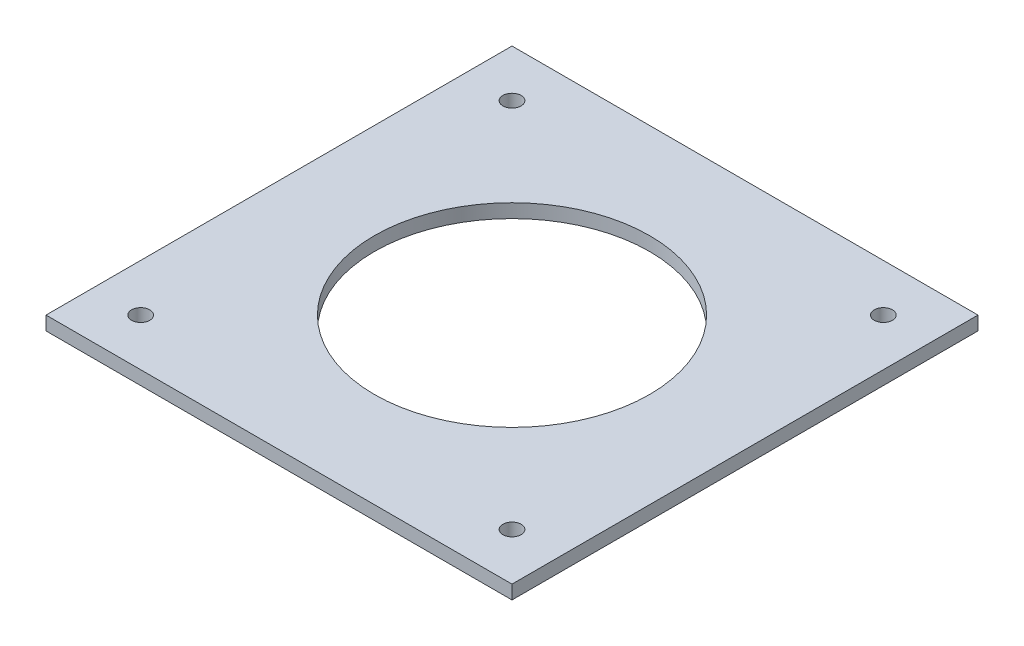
ISO-10303-21;
HEADER;
FILE_DESCRIPTION(('STEP AP214'),'2;1');
FILE_NAME('part.step','',(''),(''),'','','');
FILE_SCHEMA(('AUTOMOTIVE_DESIGN { 1 0 10303 214 1 1 1 1 }'));
ENDSEC;
DATA;
#1=APPLICATION_CONTEXT('core data for automotive mechanical design processes');
#2=APPLICATION_PROTOCOL_DEFINITION('international standard','automotive_design',2000,#1);
#3=PRODUCT_CONTEXT('',#1,'mechanical');
#4=PRODUCT('Part','Part','',(#3));
#5=PRODUCT_RELATED_PRODUCT_CATEGORY('part','',(#4));
#6=PRODUCT_DEFINITION_FORMATION('','',#4);
#7=PRODUCT_DEFINITION_CONTEXT('part definition',#1,'design');
#8=PRODUCT_DEFINITION('design','',#6,#7);
#9=PRODUCT_DEFINITION_SHAPE('','',#8);
#10=(LENGTH_UNIT() NAMED_UNIT(*) SI_UNIT(.MILLI.,.METRE.));
#11=(NAMED_UNIT(*) PLANE_ANGLE_UNIT() SI_UNIT($,.RADIAN.));
#12=(NAMED_UNIT(*) SI_UNIT($,.STERADIAN.) SOLID_ANGLE_UNIT());
#13=UNCERTAINTY_MEASURE_WITH_UNIT(LENGTH_MEASURE(1.E-05),#10,'distance_accuracy_value','');
#14=(GEOMETRIC_REPRESENTATION_CONTEXT(3) GLOBAL_UNCERTAINTY_ASSIGNED_CONTEXT((#13)) GLOBAL_UNIT_ASSIGNED_CONTEXT((#10,
#11,#12)) REPRESENTATION_CONTEXT('',''));
#15=CARTESIAN_POINT('',(0.,0.,0.));
#16=DIRECTION('',(0.,0.,1.));
#17=DIRECTION('',(1.,0.,0.));
#18=AXIS2_PLACEMENT_3D('',#15,#16,#17);
#19=CARTESIAN_POINT('',(0.,3.,0.));
#20=DIRECTION('',(0.,1.,0.));
#21=DIRECTION('',(0.,0.,1.));
#22=AXIS2_PLACEMENT_3D('',#19,#20,#21);
#23=PLANE('',#22);
#24=CARTESIAN_POINT('',(40.4799999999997,3.,40.4800000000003));
#25=DIRECTION('',(0.,1.,0.));
#26=DIRECTION('',(0.,0.,1.));
#27=AXIS2_PLACEMENT_3D('',#24,#25,#26);
#28=CIRCLE('',#27,1.98499999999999);
#29=CARTESIAN_POINT('',(40.4799999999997,3.,42.4650000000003));
#30=VERTEX_POINT('',#29);
#31=EDGE_CURVE('E156',#30,#30,#28,.T.);
#32=ORIENTED_EDGE('',*,*,#31,.F.);
#33=EDGE_LOOP('',(#32));
#34=FACE_BOUND('',#33,.T.);
#35=CARTESIAN_POINT('',(-40.48,3.,-40.48));
#36=DIRECTION('',(0.,1.,0.));
#37=DIRECTION('',(0.,0.,1.));
#38=AXIS2_PLACEMENT_3D('',#35,#36,#37);
#39=CIRCLE('',#38,1.98499999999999);
#40=CARTESIAN_POINT('',(-40.48,3.,-38.495));
#41=VERTEX_POINT('',#40);
#42=EDGE_CURVE('E140',#41,#41,#39,.T.);
#43=ORIENTED_EDGE('',*,*,#42,.F.);
#44=EDGE_LOOP('',(#43));
#45=FACE_BOUND('',#44,.T.);
#46=DIRECTION('',(0.,0.,1.));
#47=VECTOR('',#46,1.);
#48=CARTESIAN_POINT('',(-50.8,3.,-50.8));
#49=LINE('',#48,#47);
#50=CARTESIAN_POINT('',(-50.8,3.,-50.8));
#51=VERTEX_POINT('',#50);
#52=CARTESIAN_POINT('',(-50.8,3.,50.8));
#53=VERTEX_POINT('',#52);
#54=EDGE_CURVE('E98',#51,#53,#49,.T.);
#55=ORIENTED_EDGE('',*,*,#54,.T.);
#56=DIRECTION('',(1.,0.,0.));
#57=VECTOR('',#56,1.);
#58=CARTESIAN_POINT('',(-50.8,3.,50.8));
#59=LINE('',#58,#57);
#60=CARTESIAN_POINT('',(50.8,3.,50.8));
#61=VERTEX_POINT('',#60);
#62=EDGE_CURVE('E93',#53,#61,#59,.T.);
#63=ORIENTED_EDGE('',*,*,#62,.T.);
#64=DIRECTION('',(0.,0.,-1.));
#65=VECTOR('',#64,1.);
#66=CARTESIAN_POINT('',(50.8,3.,-50.8));
#67=LINE('',#66,#65);
#68=CARTESIAN_POINT('',(50.8,3.,-50.8));
#69=VERTEX_POINT('',#68);
#70=EDGE_CURVE('E96',#61,#69,#67,.T.);
#71=ORIENTED_EDGE('',*,*,#70,.T.);
#72=DIRECTION('',(-1.,0.,0.));
#73=VECTOR('',#72,1.);
#74=CARTESIAN_POINT('',(-50.8,3.,-50.8));
#75=LINE('',#74,#73);
#76=EDGE_CURVE('E63',#69,#51,#75,.T.);
#77=ORIENTED_EDGE('',*,*,#76,.T.);
#78=EDGE_LOOP('',(#55,#63,#71,#77));
#79=FACE_BOUND('',#78,.T.);
#80=CARTESIAN_POINT('',(0.,3.,0.));
#81=DIRECTION('',(0.,1.,0.));
#82=DIRECTION('',(0.,0.,1.));
#83=AXIS2_PLACEMENT_3D('',#80,#81,#82);
#84=CIRCLE('',#83,30.);
#85=CARTESIAN_POINT('',(0.,3.,30.));
#86=VERTEX_POINT('',#85);
#87=EDGE_CURVE('E118',#86,#86,#84,.T.);
#88=ORIENTED_EDGE('',*,*,#87,.F.);
#89=EDGE_LOOP('',(#88));
#90=FACE_BOUND('',#89,.T.);
#91=CARTESIAN_POINT('',(40.4800000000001,3.,-40.4799999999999));
#92=DIRECTION('',(0.,1.,0.));
#93=DIRECTION('',(0.,0.,1.));
#94=AXIS2_PLACEMENT_3D('',#91,#92,#93);
#95=CIRCLE('',#94,1.985);
#96=CARTESIAN_POINT('',(40.4800000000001,3.,-38.4949999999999));
#97=VERTEX_POINT('',#96);
#98=EDGE_CURVE('E148',#97,#97,#95,.T.);
#99=ORIENTED_EDGE('',*,*,#98,.F.);
#100=EDGE_LOOP('',(#99));
#101=FACE_BOUND('',#100,.T.);
#102=CARTESIAN_POINT('',(-40.4800000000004,3.,40.4799999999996));
#103=DIRECTION('',(0.,1.,0.));
#104=DIRECTION('',(0.,0.,1.));
#105=AXIS2_PLACEMENT_3D('',#102,#103,#104);
#106=CIRCLE('',#105,1.98499999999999);
#107=CARTESIAN_POINT('',(-40.4800000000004,3.,42.4649999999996));
#108=VERTEX_POINT('',#107);
#109=EDGE_CURVE('E164',#108,#108,#106,.T.);
#110=ORIENTED_EDGE('',*,*,#109,.F.);
#111=EDGE_LOOP('',(#110));
#112=FACE_BOUND('',#111,.T.);
#113=ADVANCED_FACE('F45',(#34,#45,#79,#90,#101,#112),#23,.T.);
#114=CARTESIAN_POINT('',(0.,0.,0.));
#115=DIRECTION('',(0.,1.,0.));
#116=DIRECTION('',(0.,0.,1.));
#117=AXIS2_PLACEMENT_3D('',#114,#115,#116);
#118=PLANE('',#117);
#119=DIRECTION('',(0.,0.,1.));
#120=VECTOR('',#119,1.);
#121=CARTESIAN_POINT('',(-50.8,0.,-50.8));
#122=LINE('',#121,#120);
#123=CARTESIAN_POINT('',(-50.8,0.,-50.8));
#124=VERTEX_POINT('',#123);
#125=CARTESIAN_POINT('',(-50.8,0.,50.8));
#126=VERTEX_POINT('',#125);
#127=EDGE_CURVE('E114',#124,#126,#122,.T.);
#128=ORIENTED_EDGE('',*,*,#127,.F.);
#129=DIRECTION('',(-1.,0.,0.));
#130=VECTOR('',#129,1.);
#131=CARTESIAN_POINT('',(-50.8,0.,-50.8));
#132=LINE('',#131,#130);
#133=CARTESIAN_POINT('',(50.8,0.,-50.8));
#134=VERTEX_POINT('',#133);
#135=EDGE_CURVE('E86',#134,#124,#132,.T.);
#136=ORIENTED_EDGE('',*,*,#135,.F.);
#137=DIRECTION('',(0.,0.,-1.));
#138=VECTOR('',#137,1.);
#139=CARTESIAN_POINT('',(50.8,0.,-50.8));
#140=LINE('',#139,#138);
#141=CARTESIAN_POINT('',(50.8,0.,50.8));
#142=VERTEX_POINT('',#141);
#143=EDGE_CURVE('E80',#142,#134,#140,.T.);
#144=ORIENTED_EDGE('',*,*,#143,.F.);
#145=DIRECTION('',(1.,0.,0.));
#146=VECTOR('',#145,1.);
#147=CARTESIAN_POINT('',(-50.8,0.,50.8));
#148=LINE('',#147,#146);
#149=EDGE_CURVE('E103',#126,#142,#148,.T.);
#150=ORIENTED_EDGE('',*,*,#149,.F.);
#151=EDGE_LOOP('',(#128,#136,#144,#150));
#152=FACE_BOUND('',#151,.T.);
#153=CARTESIAN_POINT('',(0.,0.,0.));
#154=DIRECTION('',(0.,1.,0.));
#155=DIRECTION('',(0.,0.,1.));
#156=AXIS2_PLACEMENT_3D('',#153,#154,#155);
#157=CIRCLE('',#156,30.);
#158=CARTESIAN_POINT('',(0.,0.,30.));
#159=VERTEX_POINT('',#158);
#160=EDGE_CURVE('E136',#159,#159,#157,.T.);
#161=ORIENTED_EDGE('',*,*,#160,.T.);
#162=EDGE_LOOP('',(#161));
#163=FACE_BOUND('',#162,.T.);
#164=CARTESIAN_POINT('',(-40.48,0.,-40.48));
#165=DIRECTION('',(0.,1.,0.));
#166=DIRECTION('',(0.,0.,1.));
#167=AXIS2_PLACEMENT_3D('',#164,#165,#166);
#168=CIRCLE('',#167,1.98499999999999);
#169=CARTESIAN_POINT('',(-40.48,0.,-38.495));
#170=VERTEX_POINT('',#169);
#171=EDGE_CURVE('E144',#170,#170,#168,.T.);
#172=ORIENTED_EDGE('',*,*,#171,.T.);
#173=EDGE_LOOP('',(#172));
#174=FACE_BOUND('',#173,.T.);
#175=CARTESIAN_POINT('',(40.4800000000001,0.,-40.4799999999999));
#176=DIRECTION('',(0.,1.,0.));
#177=DIRECTION('',(0.,0.,1.));
#178=AXIS2_PLACEMENT_3D('',#175,#176,#177);
#179=CIRCLE('',#178,1.985);
#180=CARTESIAN_POINT('',(40.4800000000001,0.,-38.4949999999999));
#181=VERTEX_POINT('',#180);
#182=EDGE_CURVE('E152',#181,#181,#179,.T.);
#183=ORIENTED_EDGE('',*,*,#182,.T.);
#184=EDGE_LOOP('',(#183));
#185=FACE_BOUND('',#184,.T.);
#186=CARTESIAN_POINT('',(40.4799999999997,0.,40.4800000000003));
#187=DIRECTION('',(0.,1.,0.));
#188=DIRECTION('',(0.,0.,1.));
#189=AXIS2_PLACEMENT_3D('',#186,#187,#188);
#190=CIRCLE('',#189,1.98499999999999);
#191=CARTESIAN_POINT('',(40.4799999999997,0.,42.4650000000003));
#192=VERTEX_POINT('',#191);
#193=EDGE_CURVE('E160',#192,#192,#190,.T.);
#194=ORIENTED_EDGE('',*,*,#193,.T.);
#195=EDGE_LOOP('',(#194));
#196=FACE_BOUND('',#195,.T.);
#197=CARTESIAN_POINT('',(-40.4800000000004,0.,40.4799999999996));
#198=DIRECTION('',(0.,1.,0.));
#199=DIRECTION('',(0.,0.,1.));
#200=AXIS2_PLACEMENT_3D('',#197,#198,#199);
#201=CIRCLE('',#200,1.98499999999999);
#202=CARTESIAN_POINT('',(-40.4800000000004,0.,42.4649999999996));
#203=VERTEX_POINT('',#202);
#204=EDGE_CURVE('E168',#203,#203,#201,.T.);
#205=ORIENTED_EDGE('',*,*,#204,.T.);
#206=EDGE_LOOP('',(#205));
#207=FACE_BOUND('',#206,.T.);
#208=ADVANCED_FACE('F131',(#152,#163,#174,#185,#196,#207),#118,.F.);
#209=CARTESIAN_POINT('',(-50.8,3.,-50.8));
#210=DIRECTION('',(1.,0.,0.));
#211=DIRECTION('',(0.,0.,-1.));
#212=AXIS2_PLACEMENT_3D('',#209,#210,#211);
#213=PLANE('',#212);
#214=ORIENTED_EDGE('',*,*,#127,.T.);
#215=DIRECTION('',(0.,-1.,0.));
#216=VECTOR('',#215,1.);
#217=CARTESIAN_POINT('',(-50.8,3.,50.8));
#218=LINE('',#217,#216);
#219=EDGE_CURVE('E11',#53,#126,#218,.T.);
#220=ORIENTED_EDGE('',*,*,#219,.F.);
#221=ORIENTED_EDGE('',*,*,#54,.F.);
#222=DIRECTION('',(0.,-1.,0.));
#223=VECTOR('',#222,1.);
#224=CARTESIAN_POINT('',(-50.8,3.,-50.8));
#225=LINE('',#224,#223);
#226=EDGE_CURVE('E110',#51,#124,#225,.T.);
#227=ORIENTED_EDGE('',*,*,#226,.T.);
#228=EDGE_LOOP('',(#214,#220,#221,#227));
#229=FACE_BOUND('',#228,.T.);
#230=ADVANCED_FACE('F47',(#229),#213,.F.);
#231=CARTESIAN_POINT('',(-50.8,3.,50.8));
#232=DIRECTION('',(0.,0.,-1.));
#233=DIRECTION('',(-1.,0.,0.));
#234=AXIS2_PLACEMENT_3D('',#231,#232,#233);
#235=PLANE('',#234);
#236=ORIENTED_EDGE('',*,*,#149,.T.);
#237=DIRECTION('',(0.,-1.,0.));
#238=VECTOR('',#237,1.);
#239=CARTESIAN_POINT('',(50.8,3.,50.8));
#240=LINE('',#239,#238);
#241=EDGE_CURVE('E55',#61,#142,#240,.T.);
#242=ORIENTED_EDGE('',*,*,#241,.F.);
#243=ORIENTED_EDGE('',*,*,#62,.F.);
#244=ORIENTED_EDGE('',*,*,#219,.T.);
#245=EDGE_LOOP('',(#236,#242,#243,#244));
#246=FACE_BOUND('',#245,.T.);
#247=ADVANCED_FACE('F102',(#246),#235,.F.);
#248=CARTESIAN_POINT('',(50.8,3.,-50.8));
#249=DIRECTION('',(-1.,0.,0.));
#250=DIRECTION('',(0.,0.,1.));
#251=AXIS2_PLACEMENT_3D('',#248,#249,#250);
#252=PLANE('',#251);
#253=ORIENTED_EDGE('',*,*,#143,.T.);
#254=DIRECTION('',(0.,-1.,0.));
#255=VECTOR('',#254,1.);
#256=CARTESIAN_POINT('',(50.8,3.,-50.8));
#257=LINE('',#256,#255);
#258=EDGE_CURVE('E105',#69,#134,#257,.T.);
#259=ORIENTED_EDGE('',*,*,#258,.F.);
#260=ORIENTED_EDGE('',*,*,#70,.F.);
#261=ORIENTED_EDGE('',*,*,#241,.T.);
#262=EDGE_LOOP('',(#253,#259,#260,#261));
#263=FACE_BOUND('',#262,.T.);
#264=ADVANCED_FACE('F106',(#263),#252,.F.);
#265=CARTESIAN_POINT('',(-50.8,3.,-50.8));
#266=DIRECTION('',(0.,0.,1.));
#267=DIRECTION('',(1.,0.,0.));
#268=AXIS2_PLACEMENT_3D('',#265,#266,#267);
#269=PLANE('',#268);
#270=ORIENTED_EDGE('',*,*,#135,.T.);
#271=ORIENTED_EDGE('',*,*,#226,.F.);
#272=ORIENTED_EDGE('',*,*,#76,.F.);
#273=ORIENTED_EDGE('',*,*,#258,.T.);
#274=EDGE_LOOP('',(#270,#271,#272,#273));
#275=FACE_BOUND('',#274,.T.);
#276=ADVANCED_FACE('F128',(#275),#269,.F.);
#277=CARTESIAN_POINT('',(0.,3.,0.));
#278=DIRECTION('',(0.,-1.,0.));
#279=DIRECTION('',(0.,0.,-1.));
#280=AXIS2_PLACEMENT_3D('',#277,#278,#279);
#281=CYLINDRICAL_SURFACE('',#280,30.);
#282=ORIENTED_EDGE('',*,*,#87,.T.);
#283=EDGE_LOOP('',(#282));
#284=FACE_BOUND('',#283,.T.);
#285=ORIENTED_EDGE('',*,*,#160,.F.);
#286=EDGE_LOOP('',(#285));
#287=FACE_BOUND('',#286,.T.);
#288=ADVANCED_FACE('F189',(#284,#287),#281,.F.);
#289=CARTESIAN_POINT('',(-40.48,3.,-40.48));
#290=DIRECTION('',(0.,-1.,0.));
#291=DIRECTION('',(0.,0.,-1.));
#292=AXIS2_PLACEMENT_3D('',#289,#290,#291);
#293=CYLINDRICAL_SURFACE('',#292,1.98499999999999);
#294=ORIENTED_EDGE('',*,*,#42,.T.);
#295=EDGE_LOOP('',(#294));
#296=FACE_BOUND('',#295,.T.);
#297=ORIENTED_EDGE('',*,*,#171,.F.);
#298=EDGE_LOOP('',(#297));
#299=FACE_BOUND('',#298,.T.);
#300=ADVANCED_FACE('F234',(#296,#299),#293,.F.);
#301=CARTESIAN_POINT('',(40.4800000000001,3.,-40.4799999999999));
#302=DIRECTION('',(0.,-1.,0.));
#303=DIRECTION('',(0.,0.,-1.));
#304=AXIS2_PLACEMENT_3D('',#301,#302,#303);
#305=CYLINDRICAL_SURFACE('',#304,1.985);
#306=ORIENTED_EDGE('',*,*,#98,.T.);
#307=EDGE_LOOP('',(#306));
#308=FACE_BOUND('',#307,.T.);
#309=ORIENTED_EDGE('',*,*,#182,.F.);
#310=EDGE_LOOP('',(#309));
#311=FACE_BOUND('',#310,.T.);
#312=ADVANCED_FACE('F242',(#308,#311),#305,.F.);
#313=CARTESIAN_POINT('',(40.4799999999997,3.,40.4800000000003));
#314=DIRECTION('',(0.,-1.,0.));
#315=DIRECTION('',(0.,0.,-1.));
#316=AXIS2_PLACEMENT_3D('',#313,#314,#315);
#317=CYLINDRICAL_SURFACE('',#316,1.98499999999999);
#318=ORIENTED_EDGE('',*,*,#31,.T.);
#319=EDGE_LOOP('',(#318));
#320=FACE_BOUND('',#319,.T.);
#321=ORIENTED_EDGE('',*,*,#193,.F.);
#322=EDGE_LOOP('',(#321));
#323=FACE_BOUND('',#322,.T.);
#324=ADVANCED_FACE('F250',(#320,#323),#317,.F.);
#325=CARTESIAN_POINT('',(-40.4800000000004,3.,40.4799999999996));
#326=DIRECTION('',(0.,-1.,0.));
#327=DIRECTION('',(0.,0.,-1.));
#328=AXIS2_PLACEMENT_3D('',#325,#326,#327);
#329=CYLINDRICAL_SURFACE('',#328,1.98499999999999);
#330=ORIENTED_EDGE('',*,*,#109,.T.);
#331=EDGE_LOOP('',(#330));
#332=FACE_BOUND('',#331,.T.);
#333=ORIENTED_EDGE('',*,*,#204,.F.);
#334=EDGE_LOOP('',(#333));
#335=FACE_BOUND('',#334,.T.);
#336=ADVANCED_FACE('F176',(#332,#335),#329,.F.);
#337=CLOSED_SHELL('',(#113,#208,#230,#247,#264,#276,#288,#300,#312,#324,#336));
#338=MANIFOLD_SOLID_BREP('B2',#337);
#339=ADVANCED_BREP_SHAPE_REPRESENTATION('',(#18,#338),#14);
#340=SHAPE_DEFINITION_REPRESENTATION(#9,#339);
ENDSEC;
END-ISO-10303-21;
